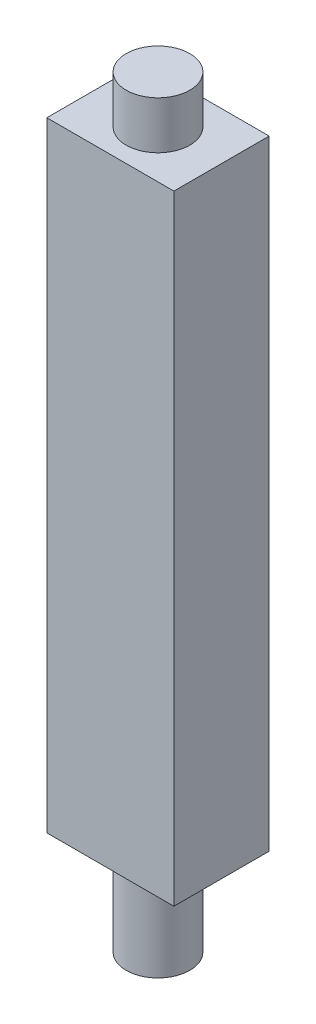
ISO-10303-21;
HEADER;
FILE_DESCRIPTION(('STEP AP214'),'2;1');
FILE_NAME('part.step','',(''),(''),'','','');
FILE_SCHEMA(('AUTOMOTIVE_DESIGN { 1 0 10303 214 1 1 1 1 }'));
ENDSEC;
DATA;
#1=APPLICATION_CONTEXT('core data for automotive mechanical design processes');
#2=APPLICATION_PROTOCOL_DEFINITION('international standard','automotive_design',2000,#1);
#3=PRODUCT_CONTEXT('',#1,'mechanical');
#4=PRODUCT('Part','Part','',(#3));
#5=PRODUCT_RELATED_PRODUCT_CATEGORY('part','',(#4));
#6=PRODUCT_DEFINITION_FORMATION('','',#4);
#7=PRODUCT_DEFINITION_CONTEXT('part definition',#1,'design');
#8=PRODUCT_DEFINITION('design','',#6,#7);
#9=PRODUCT_DEFINITION_SHAPE('','',#8);
#10=(LENGTH_UNIT() NAMED_UNIT(*) SI_UNIT(.MILLI.,.METRE.));
#11=(NAMED_UNIT(*) PLANE_ANGLE_UNIT() SI_UNIT($,.RADIAN.));
#12=(NAMED_UNIT(*) SI_UNIT($,.STERADIAN.) SOLID_ANGLE_UNIT());
#13=UNCERTAINTY_MEASURE_WITH_UNIT(LENGTH_MEASURE(1.E-05),#10,'distance_accuracy_value','');
#14=(GEOMETRIC_REPRESENTATION_CONTEXT(3) GLOBAL_UNCERTAINTY_ASSIGNED_CONTEXT((#13)) GLOBAL_UNIT_ASSIGNED_CONTEXT((#10,
#11,#12)) REPRESENTATION_CONTEXT('',''));
#15=CARTESIAN_POINT('',(0.,0.,0.));
#16=DIRECTION('',(0.,0.,1.));
#17=DIRECTION('',(1.,0.,0.));
#18=AXIS2_PLACEMENT_3D('',#15,#16,#17);
#19=CARTESIAN_POINT('',(0.,22.5,0.));
#20=DIRECTION('',(0.,-1.,0.));
#21=DIRECTION('',(0.,0.,-1.));
#22=AXIS2_PLACEMENT_3D('',#19,#20,#21);
#23=PLANE('',#22);
#24=DIRECTION('',(0.,0.,-1.));
#25=VECTOR('',#24,1.);
#26=CARTESIAN_POINT('',(2.,22.5,1.5));
#27=LINE('',#26,#25);
#28=CARTESIAN_POINT('',(2.,22.5,1.5));
#29=VERTEX_POINT('',#28);
#30=CARTESIAN_POINT('',(2.,22.5,-1.5));
#31=VERTEX_POINT('',#30);
#32=EDGE_CURVE('E88',#29,#31,#27,.T.);
#33=ORIENTED_EDGE('',*,*,#32,.T.);
#34=DIRECTION('',(-1.,0.,0.));
#35=VECTOR('',#34,1.);
#36=CARTESIAN_POINT('',(-2.,22.5,-1.5));
#37=LINE('',#36,#35);
#38=CARTESIAN_POINT('',(-2.,22.5,-1.5));
#39=VERTEX_POINT('',#38);
#40=EDGE_CURVE('E83',#31,#39,#37,.T.);
#41=ORIENTED_EDGE('',*,*,#40,.T.);
#42=DIRECTION('',(0.,0.,1.));
#43=VECTOR('',#42,1.);
#44=CARTESIAN_POINT('',(-2.,22.5,1.5));
#45=LINE('',#44,#43);
#46=CARTESIAN_POINT('',(-2.,22.5,1.5));
#47=VERTEX_POINT('',#46);
#48=EDGE_CURVE('E86',#39,#47,#45,.T.);
#49=ORIENTED_EDGE('',*,*,#48,.T.);
#50=DIRECTION('',(1.,0.,0.));
#51=VECTOR('',#50,1.);
#52=CARTESIAN_POINT('',(-2.,22.5,1.5));
#53=LINE('',#52,#51);
#54=EDGE_CURVE('E52',#47,#29,#53,.T.);
#55=ORIENTED_EDGE('',*,*,#54,.T.);
#56=EDGE_LOOP('',(#33,#41,#49,#55));
#57=FACE_BOUND('',#56,.T.);
#58=CARTESIAN_POINT('',(0.,22.5,0.));
#59=DIRECTION('',(0.,-1.,0.));
#60=DIRECTION('',(0.,0.,-1.));
#61=AXIS2_PLACEMENT_3D('',#58,#59,#60);
#62=CIRCLE('',#61,1.);
#63=CARTESIAN_POINT('',(0.,22.5,-1.));
#64=VERTEX_POINT('',#63);
#65=EDGE_CURVE('E11',#64,#64,#62,.F.);
#66=ORIENTED_EDGE('',*,*,#65,.F.);
#67=EDGE_LOOP('',(#66));
#68=FACE_BOUND('',#67,.T.);
#69=ADVANCED_FACE('F35',(#57,#68),#23,.F.);
#70=CARTESIAN_POINT('',(0.,3.,0.));
#71=DIRECTION('',(0.,-1.,0.));
#72=DIRECTION('',(0.,0.,-1.));
#73=AXIS2_PLACEMENT_3D('',#70,#71,#72);
#74=CYLINDRICAL_SURFACE('',#73,1.);
#75=CARTESIAN_POINT('',(0.,3.,0.));
#76=DIRECTION('',(0.,1.,0.));
#77=DIRECTION('',(0.,0.,1.));
#78=AXIS2_PLACEMENT_3D('',#75,#76,#77);
#79=CIRCLE('',#78,1.);
#80=CARTESIAN_POINT('',(0.,3.,1.));
#81=VERTEX_POINT('',#80);
#82=EDGE_CURVE('E44',#81,#81,#79,.T.);
#83=ORIENTED_EDGE('',*,*,#82,.F.);
#84=EDGE_LOOP('',(#83));
#85=FACE_BOUND('',#84,.T.);
#86=CARTESIAN_POINT('',(0.,0.,0.));
#87=DIRECTION('',(0.,1.,0.));
#88=DIRECTION('',(0.,0.,1.));
#89=AXIS2_PLACEMENT_3D('',#86,#87,#88);
#90=CIRCLE('',#89,1.);
#91=CARTESIAN_POINT('',(0.,0.,1.));
#92=VERTEX_POINT('',#91);
#93=EDGE_CURVE('E113',#92,#92,#90,.T.);
#94=ORIENTED_EDGE('',*,*,#93,.T.);
#95=EDGE_LOOP('',(#94));
#96=FACE_BOUND('',#95,.T.);
#97=ADVANCED_FACE('F37',(#85,#96),#74,.T.);
#98=CARTESIAN_POINT('',(0.,0.,0.));
#99=DIRECTION('',(0.,1.,0.));
#100=DIRECTION('',(0.,0.,1.));
#101=AXIS2_PLACEMENT_3D('',#98,#99,#100);
#102=PLANE('',#101);
#103=ORIENTED_EDGE('',*,*,#93,.F.);
#104=EDGE_LOOP('',(#103));
#105=FACE_BOUND('',#104,.T.);
#106=ADVANCED_FACE('F119',(#105),#102,.F.);
#107=CARTESIAN_POINT('',(0.,3.,0.));
#108=DIRECTION('',(0.,-1.,0.));
#109=DIRECTION('',(0.,0.,-1.));
#110=AXIS2_PLACEMENT_3D('',#107,#108,#109);
#111=PLANE('',#110);
#112=DIRECTION('',(0.,0.,-1.));
#113=VECTOR('',#112,1.);
#114=CARTESIAN_POINT('',(2.,3.,1.5));
#115=LINE('',#114,#113);
#116=CARTESIAN_POINT('',(2.,3.,1.5));
#117=VERTEX_POINT('',#116);
#118=CARTESIAN_POINT('',(2.,3.,-1.5));
#119=VERTEX_POINT('',#118);
#120=EDGE_CURVE('E103',#117,#119,#115,.T.);
#121=ORIENTED_EDGE('',*,*,#120,.F.);
#122=DIRECTION('',(1.,0.,0.));
#123=VECTOR('',#122,1.);
#124=CARTESIAN_POINT('',(-2.,3.,1.5));
#125=LINE('',#124,#123);
#126=CARTESIAN_POINT('',(-2.,3.,1.5));
#127=VERTEX_POINT('',#126);
#128=EDGE_CURVE('E75',#127,#117,#125,.T.);
#129=ORIENTED_EDGE('',*,*,#128,.F.);
#130=DIRECTION('',(0.,0.,1.));
#131=VECTOR('',#130,1.);
#132=CARTESIAN_POINT('',(-2.,3.,1.5));
#133=LINE('',#132,#131);
#134=CARTESIAN_POINT('',(-2.,3.,-1.5));
#135=VERTEX_POINT('',#134);
#136=EDGE_CURVE('E69',#135,#127,#133,.T.);
#137=ORIENTED_EDGE('',*,*,#136,.F.);
#138=DIRECTION('',(-1.,0.,0.));
#139=VECTOR('',#138,1.);
#140=CARTESIAN_POINT('',(-2.,3.,-1.5));
#141=LINE('',#140,#139);
#142=EDGE_CURVE('E93',#119,#135,#141,.T.);
#143=ORIENTED_EDGE('',*,*,#142,.F.);
#144=EDGE_LOOP('',(#121,#129,#137,#143));
#145=FACE_BOUND('',#144,.T.);
#146=ORIENTED_EDGE('',*,*,#82,.T.);
#147=EDGE_LOOP('',(#146));
#148=FACE_BOUND('',#147,.T.);
#149=ADVANCED_FACE('F121',(#145,#148),#111,.T.);
#150=CARTESIAN_POINT('',(2.,22.5,1.5));
#151=DIRECTION('',(-1.,0.,0.));
#152=DIRECTION('',(0.,0.,1.));
#153=AXIS2_PLACEMENT_3D('',#150,#151,#152);
#154=PLANE('',#153);
#155=ORIENTED_EDGE('',*,*,#120,.T.);
#156=DIRECTION('',(0.,-1.,0.));
#157=VECTOR('',#156,1.);
#158=CARTESIAN_POINT('',(2.,22.5,-1.5));
#159=LINE('',#158,#157);
#160=EDGE_CURVE('E94',#31,#119,#159,.T.);
#161=ORIENTED_EDGE('',*,*,#160,.F.);
#162=ORIENTED_EDGE('',*,*,#32,.F.);
#163=DIRECTION('',(0.,-1.,0.));
#164=VECTOR('',#163,1.);
#165=CARTESIAN_POINT('',(2.,22.5,1.5));
#166=LINE('',#165,#164);
#167=EDGE_CURVE('E99',#29,#117,#166,.T.);
#168=ORIENTED_EDGE('',*,*,#167,.T.);
#169=EDGE_LOOP('',(#155,#161,#162,#168));
#170=FACE_BOUND('',#169,.T.);
#171=ADVANCED_FACE('F126',(#170),#154,.F.);
#172=CARTESIAN_POINT('',(-2.,22.5,-1.5));
#173=DIRECTION('',(0.,0.,1.));
#174=DIRECTION('',(1.,0.,0.));
#175=AXIS2_PLACEMENT_3D('',#172,#173,#174);
#176=PLANE('',#175);
#177=ORIENTED_EDGE('',*,*,#142,.T.);
#178=DIRECTION('',(0.,-1.,0.));
#179=VECTOR('',#178,1.);
#180=CARTESIAN_POINT('',(-2.,22.5,-1.5));
#181=LINE('',#180,#179);
#182=EDGE_CURVE('E91',#39,#135,#181,.T.);
#183=ORIENTED_EDGE('',*,*,#182,.F.);
#184=ORIENTED_EDGE('',*,*,#40,.F.);
#185=ORIENTED_EDGE('',*,*,#160,.T.);
#186=EDGE_LOOP('',(#177,#183,#184,#185));
#187=FACE_BOUND('',#186,.T.);
#188=ADVANCED_FACE('F92',(#187),#176,.F.);
#189=CARTESIAN_POINT('',(-2.,22.5,1.5));
#190=DIRECTION('',(1.,0.,0.));
#191=DIRECTION('',(0.,0.,-1.));
#192=AXIS2_PLACEMENT_3D('',#189,#190,#191);
#193=PLANE('',#192);
#194=ORIENTED_EDGE('',*,*,#136,.T.);
#195=DIRECTION('',(0.,-1.,0.));
#196=VECTOR('',#195,1.);
#197=CARTESIAN_POINT('',(-2.,22.5,1.5));
#198=LINE('',#197,#196);
#199=EDGE_CURVE('E95',#47,#127,#198,.T.);
#200=ORIENTED_EDGE('',*,*,#199,.F.);
#201=ORIENTED_EDGE('',*,*,#48,.F.);
#202=ORIENTED_EDGE('',*,*,#182,.T.);
#203=EDGE_LOOP('',(#194,#200,#201,#202));
#204=FACE_BOUND('',#203,.T.);
#205=ADVANCED_FACE('F97',(#204),#193,.F.);
#206=CARTESIAN_POINT('',(-2.,22.5,1.5));
#207=DIRECTION('',(0.,0.,-1.));
#208=DIRECTION('',(-1.,0.,0.));
#209=AXIS2_PLACEMENT_3D('',#206,#207,#208);
#210=PLANE('',#209);
#211=ORIENTED_EDGE('',*,*,#128,.T.);
#212=ORIENTED_EDGE('',*,*,#167,.F.);
#213=ORIENTED_EDGE('',*,*,#54,.F.);
#214=ORIENTED_EDGE('',*,*,#199,.T.);
#215=EDGE_LOOP('',(#211,#212,#213,#214));
#216=FACE_BOUND('',#215,.T.);
#217=ADVANCED_FACE('F139',(#216),#210,.F.);
#218=CARTESIAN_POINT('',(0.,24.,0.));
#219=DIRECTION('',(0.,-1.,0.));
#220=DIRECTION('',(0.,0.,-1.));
#221=AXIS2_PLACEMENT_3D('',#218,#219,#220);
#222=CYLINDRICAL_SURFACE('',#221,1.);
#223=CARTESIAN_POINT('',(0.,24.,0.));
#224=DIRECTION('',(0.,1.,0.));
#225=DIRECTION('',(0.,0.,1.));
#226=AXIS2_PLACEMENT_3D('',#223,#224,#225);
#227=CIRCLE('',#226,1.);
#228=CARTESIAN_POINT('',(0.,24.,1.));
#229=VERTEX_POINT('',#228);
#230=EDGE_CURVE('E106',#229,#229,#227,.T.);
#231=ORIENTED_EDGE('',*,*,#230,.F.);
#232=EDGE_LOOP('',(#231));
#233=FACE_BOUND('',#232,.T.);
#234=ORIENTED_EDGE('',*,*,#65,.T.);
#235=EDGE_LOOP('',(#234));
#236=FACE_BOUND('',#235,.T.);
#237=ADVANCED_FACE('F136',(#233,#236),#222,.T.);
#238=CARTESIAN_POINT('',(0.,24.,0.));
#239=DIRECTION('',(0.,1.,0.));
#240=DIRECTION('',(0.,0.,1.));
#241=AXIS2_PLACEMENT_3D('',#238,#239,#240);
#242=PLANE('',#241);
#243=ORIENTED_EDGE('',*,*,#230,.T.);
#244=EDGE_LOOP('',(#243));
#245=FACE_BOUND('',#244,.T.);
#246=ADVANCED_FACE('F156',(#245),#242,.T.);
#247=CLOSED_SHELL('',(#69,#97,#106,#149,#171,#188,#205,#217,#237,#246));
#248=MANIFOLD_SOLID_BREP('B2',#247);
#249=ADVANCED_BREP_SHAPE_REPRESENTATION('',(#18,#248),#14);
#250=SHAPE_DEFINITION_REPRESENTATION(#9,#249);
ENDSEC;
END-ISO-10303-21;
